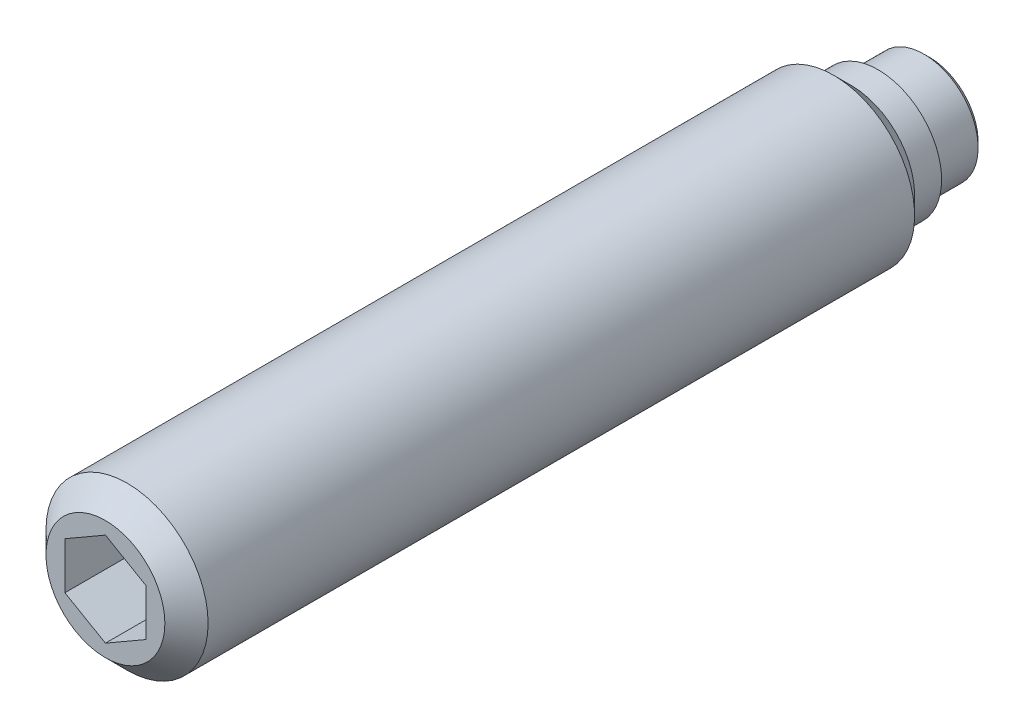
ISO-10303-21;
HEADER;
FILE_DESCRIPTION(('STEP AP214'),'2;1');
FILE_NAME('part.step','',(''),(''),'','','');
FILE_SCHEMA(('AUTOMOTIVE_DESIGN { 1 0 10303 214 1 1 1 1 }'));
ENDSEC;
DATA;
#1=APPLICATION_CONTEXT('core data for automotive mechanical design processes');
#2=APPLICATION_PROTOCOL_DEFINITION('international standard','automotive_design',2000,#1);
#3=PRODUCT_CONTEXT('',#1,'mechanical');
#4=PRODUCT('Part','Part','',(#3));
#5=PRODUCT_RELATED_PRODUCT_CATEGORY('part','',(#4));
#6=PRODUCT_DEFINITION_FORMATION('','',#4);
#7=PRODUCT_DEFINITION_CONTEXT('part definition',#1,'design');
#8=PRODUCT_DEFINITION('design','',#6,#7);
#9=PRODUCT_DEFINITION_SHAPE('','',#8);
#10=(LENGTH_UNIT() NAMED_UNIT(*) SI_UNIT(.MILLI.,.METRE.));
#11=(NAMED_UNIT(*) PLANE_ANGLE_UNIT() SI_UNIT($,.RADIAN.));
#12=(NAMED_UNIT(*) SI_UNIT($,.STERADIAN.) SOLID_ANGLE_UNIT());
#13=UNCERTAINTY_MEASURE_WITH_UNIT(LENGTH_MEASURE(1.E-05),#10,'distance_accuracy_value','');
#14=(GEOMETRIC_REPRESENTATION_CONTEXT(3) GLOBAL_UNCERTAINTY_ASSIGNED_CONTEXT((#13)) GLOBAL_UNIT_ASSIGNED_CONTEXT((#10,
#11,#12)) REPRESENTATION_CONTEXT('',''));
#15=CARTESIAN_POINT('',(0.,0.,0.));
#16=DIRECTION('',(0.,0.,1.));
#17=DIRECTION('',(1.,0.,0.));
#18=AXIS2_PLACEMENT_3D('',#15,#16,#17);
#19=CARTESIAN_POINT('',(0.,0.,1.9));
#20=DIRECTION('',(0.,0.,-1.));
#21=DIRECTION('',(-1.,0.,0.));
#22=AXIS2_PLACEMENT_3D('',#19,#20,#21);
#23=CYLINDRICAL_SURFACE('',#22,3.);
#24=CARTESIAN_POINT('',(0.,0.,29.7));
#25=DIRECTION('',(0.,0.,1.));
#26=DIRECTION('',(1.,0.,0.));
#27=AXIS2_PLACEMENT_3D('',#24,#25,#26);
#28=CIRCLE('',#27,3.);
#29=CARTESIAN_POINT('',(3.,0.,29.7));
#30=VERTEX_POINT('',#29);
#31=EDGE_CURVE('E9',#30,#30,#28,.F.);
#32=ORIENTED_EDGE('',*,*,#31,.T.);
#33=EDGE_LOOP('',(#32));
#34=FACE_BOUND('',#33,.T.);
#35=CARTESIAN_POINT('',(0.,0.,3.55));
#36=DIRECTION('',(0.,0.,-1.));
#37=DIRECTION('',(-1.,0.,0.));
#38=AXIS2_PLACEMENT_3D('',#35,#36,#37);
#39=CIRCLE('',#38,3.);
#40=CARTESIAN_POINT('',(-3.,0.,3.55));
#41=VERTEX_POINT('',#40);
#42=EDGE_CURVE('E74',#41,#41,#39,.T.);
#43=ORIENTED_EDGE('',*,*,#42,.F.);
#44=EDGE_LOOP('',(#43));
#45=FACE_BOUND('',#44,.T.);
#46=ADVANCED_FACE('F14',(#34,#45),#23,.T.);
#47=CARTESIAN_POINT('',(0.,0.,3.55));
#48=DIRECTION('',(0.,0.,1.));
#49=DIRECTION('',(1.,0.,0.));
#50=AXIS2_PLACEMENT_3D('',#47,#48,#49);
#51=CONICAL_SURFACE('',#50,3.,0.785398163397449);
#52=ORIENTED_EDGE('',*,*,#42,.T.);
#53=EDGE_LOOP('',(#52));
#54=FACE_BOUND('',#53,.T.);
#55=CARTESIAN_POINT('',(0.,0.,2.9));
#56=DIRECTION('',(0.,0.,-1.));
#57=DIRECTION('',(-1.,0.,0.));
#58=AXIS2_PLACEMENT_3D('',#55,#56,#57);
#59=CIRCLE('',#58,2.35);
#60=CARTESIAN_POINT('',(-2.35,0.,2.9));
#61=VERTEX_POINT('',#60);
#62=EDGE_CURVE('E112',#61,#61,#59,.T.);
#63=ORIENTED_EDGE('',*,*,#62,.F.);
#64=EDGE_LOOP('',(#63));
#65=FACE_BOUND('',#64,.T.);
#66=ADVANCED_FACE('F130',(#54,#65),#51,.T.);
#67=CARTESIAN_POINT('',(0.,0.,1.9));
#68=DIRECTION('',(0.,0.,-1.));
#69=DIRECTION('',(-1.,0.,0.));
#70=AXIS2_PLACEMENT_3D('',#67,#68,#69);
#71=CYLINDRICAL_SURFACE('',#70,2.35);
#72=ORIENTED_EDGE('',*,*,#62,.T.);
#73=EDGE_LOOP('',(#72));
#74=FACE_BOUND('',#73,.T.);
#75=CARTESIAN_POINT('',(0.,0.,1.9));
#76=DIRECTION('',(0.,0.,-1.));
#77=DIRECTION('',(-1.,0.,0.));
#78=AXIS2_PLACEMENT_3D('',#75,#76,#77);
#79=CIRCLE('',#78,2.35);
#80=CARTESIAN_POINT('',(-2.35,0.,1.9));
#81=VERTEX_POINT('',#80);
#82=EDGE_CURVE('E109',#81,#81,#79,.T.);
#83=ORIENTED_EDGE('',*,*,#82,.F.);
#84=EDGE_LOOP('',(#83));
#85=FACE_BOUND('',#84,.T.);
#86=ADVANCED_FACE('F135',(#74,#85),#71,.T.);
#87=CARTESIAN_POINT('',(0.,2.35,1.9));
#88=DIRECTION('',(0.,0.,1.));
#89=DIRECTION('',(1.,0.,0.));
#90=AXIS2_PLACEMENT_3D('',#87,#88,#89);
#91=PLANE('',#90);
#92=ORIENTED_EDGE('',*,*,#82,.T.);
#93=EDGE_LOOP('',(#92));
#94=FACE_BOUND('',#93,.T.);
#95=CARTESIAN_POINT('',(0.,0.,1.9));
#96=DIRECTION('',(0.,0.,-1.));
#97=DIRECTION('',(-1.,0.,0.));
#98=AXIS2_PLACEMENT_3D('',#95,#96,#97);
#99=CIRCLE('',#98,2.);
#100=CARTESIAN_POINT('',(-2.,0.,1.9));
#101=VERTEX_POINT('',#100);
#102=EDGE_CURVE('E106',#101,#101,#99,.T.);
#103=ORIENTED_EDGE('',*,*,#102,.F.);
#104=EDGE_LOOP('',(#103));
#105=FACE_BOUND('',#104,.T.);
#106=ADVANCED_FACE('F142',(#94,#105),#91,.F.);
#107=CARTESIAN_POINT('',(0.,0.,0.));
#108=DIRECTION('',(0.,0.,-1.));
#109=DIRECTION('',(-1.,0.,0.));
#110=AXIS2_PLACEMENT_3D('',#107,#108,#109);
#111=CYLINDRICAL_SURFACE('',#110,2.);
#112=CARTESIAN_POINT('',(0.,0.,0.2));
#113=DIRECTION('',(0.,0.,-1.));
#114=DIRECTION('',(-1.,0.,0.));
#115=AXIS2_PLACEMENT_3D('',#112,#113,#114);
#116=CIRCLE('',#115,2.);
#117=CARTESIAN_POINT('',(-2.,0.,0.2));
#118=VERTEX_POINT('',#117);
#119=EDGE_CURVE('E103',#118,#118,#116,.T.);
#120=ORIENTED_EDGE('',*,*,#119,.F.);
#121=EDGE_LOOP('',(#120));
#122=FACE_BOUND('',#121,.T.);
#123=ORIENTED_EDGE('',*,*,#102,.T.);
#124=EDGE_LOOP('',(#123));
#125=FACE_BOUND('',#124,.T.);
#126=ADVANCED_FACE('F146',(#122,#125),#111,.T.);
#127=CARTESIAN_POINT('',(0.,0.,0.2));
#128=DIRECTION('',(0.,0.,1.));
#129=DIRECTION('',(1.,0.,0.));
#130=AXIS2_PLACEMENT_3D('',#127,#128,#129);
#131=CONICAL_SURFACE('',#130,2.,0.785398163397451);
#132=CARTESIAN_POINT('',(0.,0.,0.));
#133=DIRECTION('',(0.,0.,-1.));
#134=DIRECTION('',(-1.,0.,0.));
#135=AXIS2_PLACEMENT_3D('',#132,#133,#134);
#136=CIRCLE('',#135,1.8);
#137=CARTESIAN_POINT('',(-1.8,0.,0.));
#138=VERTEX_POINT('',#137);
#139=EDGE_CURVE('E100',#138,#138,#136,.T.);
#140=ORIENTED_EDGE('',*,*,#139,.F.);
#141=EDGE_LOOP('',(#140));
#142=FACE_BOUND('',#141,.T.);
#143=ORIENTED_EDGE('',*,*,#119,.T.);
#144=EDGE_LOOP('',(#143));
#145=FACE_BOUND('',#144,.T.);
#146=ADVANCED_FACE('F150',(#142,#145),#131,.T.);
#147=CARTESIAN_POINT('',(0.,1.8,0.));
#148=DIRECTION('',(0.,0.,1.));
#149=DIRECTION('',(1.,0.,0.));
#150=AXIS2_PLACEMENT_3D('',#147,#148,#149);
#151=PLANE('',#150);
#152=ORIENTED_EDGE('',*,*,#139,.T.);
#153=EDGE_LOOP('',(#152));
#154=FACE_BOUND('',#153,.T.);
#155=ADVANCED_FACE('F154',(#154),#151,.F.);
#156=CARTESIAN_POINT('',(0.,0.,30.5));
#157=DIRECTION('',(0.,0.,1.));
#158=DIRECTION('',(1.,0.,0.));
#159=AXIS2_PLACEMENT_3D('',#156,#157,#158);
#160=PLANE('',#159);
#161=CARTESIAN_POINT('',(0.,0.,30.5));
#162=DIRECTION('',(0.,0.,1.));
#163=DIRECTION('',(1.,0.,0.));
#164=AXIS2_PLACEMENT_3D('',#161,#162,#163);
#165=CIRCLE('',#164,2.2);
#166=CARTESIAN_POINT('',(2.2,0.,30.5));
#167=VERTEX_POINT('',#166);
#168=EDGE_CURVE('E22',#167,#167,#165,.T.);
#169=ORIENTED_EDGE('',*,*,#168,.T.);
#170=EDGE_LOOP('',(#169));
#171=FACE_BOUND('',#170,.T.);
#172=DIRECTION('',(-0.866025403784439,0.5,0.));
#173=VECTOR('',#172,1.);
#174=CARTESIAN_POINT('',(-1.5,-0.866025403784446,30.5));
#175=LINE('',#174,#173);
#176=CARTESIAN_POINT('',(0.,-1.73205080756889,30.5));
#177=VERTEX_POINT('',#176);
#178=CARTESIAN_POINT('',(-1.5,-0.866025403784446,30.5));
#179=VERTEX_POINT('',#178);
#180=EDGE_CURVE('E69',#177,#179,#175,.T.);
#181=ORIENTED_EDGE('',*,*,#180,.T.);
#182=DIRECTION('',(0.,1.,0.));
#183=VECTOR('',#182,1.);
#184=CARTESIAN_POINT('',(-1.5,0.866025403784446,30.5));
#185=LINE('',#184,#183);
#186=CARTESIAN_POINT('',(-1.5,0.866025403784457,30.5));
#187=VERTEX_POINT('',#186);
#188=EDGE_CURVE('E84',#179,#187,#185,.T.);
#189=ORIENTED_EDGE('',*,*,#188,.T.);
#190=DIRECTION('',(0.866025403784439,0.5,0.));
#191=VECTOR('',#190,1.);
#192=CARTESIAN_POINT('',(0.,1.73205080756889,30.5));
#193=LINE('',#192,#191);
#194=CARTESIAN_POINT('',(0.,1.73205080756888,30.5));
#195=VERTEX_POINT('',#194);
#196=EDGE_CURVE('E301',#187,#195,#193,.T.);
#197=ORIENTED_EDGE('',*,*,#196,.T.);
#198=DIRECTION('',(0.866025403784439,-0.5,0.));
#199=VECTOR('',#198,1.);
#200=CARTESIAN_POINT('',(1.5,0.866025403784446,30.5));
#201=LINE('',#200,#199);
#202=CARTESIAN_POINT('',(1.5,0.866025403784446,30.5));
#203=VERTEX_POINT('',#202);
#204=EDGE_CURVE('E298',#195,#203,#201,.T.);
#205=ORIENTED_EDGE('',*,*,#204,.T.);
#206=DIRECTION('',(0.,-1.,0.));
#207=VECTOR('',#206,1.);
#208=CARTESIAN_POINT('',(1.5,-0.866025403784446,30.5));
#209=LINE('',#208,#207);
#210=CARTESIAN_POINT('',(1.5,-0.866025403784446,30.5));
#211=VERTEX_POINT('',#210);
#212=EDGE_CURVE('E29',#203,#211,#209,.T.);
#213=ORIENTED_EDGE('',*,*,#212,.T.);
#214=DIRECTION('',(-0.866025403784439,-0.5,0.));
#215=VECTOR('',#214,1.);
#216=CARTESIAN_POINT('',(0.,-1.73205080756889,30.5));
#217=LINE('',#216,#215);
#218=EDGE_CURVE('E66',#211,#177,#217,.T.);
#219=ORIENTED_EDGE('',*,*,#218,.T.);
#220=EDGE_LOOP('',(#181,#189,#197,#205,#213,#219));
#221=FACE_BOUND('',#220,.T.);
#222=ADVANCED_FACE('F68',(#171,#221),#160,.T.);
#223=CARTESIAN_POINT('',(0.,0.,27.));
#224=DIRECTION('',(0.,0.,1.));
#225=DIRECTION('',(1.,0.,0.));
#226=AXIS2_PLACEMENT_3D('',#223,#224,#225);
#227=PLANE('',#226);
#228=DIRECTION('',(0.,-1.,0.));
#229=VECTOR('',#228,1.);
#230=CARTESIAN_POINT('',(-1.5,0.866025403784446,27.));
#231=LINE('',#230,#229);
#232=CARTESIAN_POINT('',(-1.5,0.866025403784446,27.));
#233=VERTEX_POINT('',#232);
#234=CARTESIAN_POINT('',(-1.5,-0.866025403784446,27.));
#235=VERTEX_POINT('',#234);
#236=EDGE_CURVE('E83',#233,#235,#231,.T.);
#237=ORIENTED_EDGE('',*,*,#236,.T.);
#238=DIRECTION('',(0.866025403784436,-0.5,0.));
#239=VECTOR('',#238,1.);
#240=CARTESIAN_POINT('',(-1.5,-0.866025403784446,27.));
#241=LINE('',#240,#239);
#242=CARTESIAN_POINT('',(0.,-1.73205080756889,27.));
#243=VERTEX_POINT('',#242);
#244=EDGE_CURVE('E280',#235,#243,#241,.T.);
#245=ORIENTED_EDGE('',*,*,#244,.T.);
#246=DIRECTION('',(0.866025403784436,0.5,0.));
#247=VECTOR('',#246,1.);
#248=CARTESIAN_POINT('',(0.,-1.73205080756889,27.));
#249=LINE('',#248,#247);
#250=CARTESIAN_POINT('',(1.5,-0.866025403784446,27.));
#251=VERTEX_POINT('',#250);
#252=EDGE_CURVE('E88',#243,#251,#249,.T.);
#253=ORIENTED_EDGE('',*,*,#252,.T.);
#254=DIRECTION('',(0.,1.,0.));
#255=VECTOR('',#254,1.);
#256=CARTESIAN_POINT('',(1.5,-0.866025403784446,27.));
#257=LINE('',#256,#255);
#258=CARTESIAN_POINT('',(1.5,0.866025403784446,27.));
#259=VERTEX_POINT('',#258);
#260=EDGE_CURVE('E287',#251,#259,#257,.T.);
#261=ORIENTED_EDGE('',*,*,#260,.T.);
#262=DIRECTION('',(-0.866025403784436,0.5,0.));
#263=VECTOR('',#262,1.);
#264=CARTESIAN_POINT('',(1.5,0.866025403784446,27.));
#265=LINE('',#264,#263);
#266=CARTESIAN_POINT('',(0.,1.73205080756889,27.));
#267=VERTEX_POINT('',#266);
#268=EDGE_CURVE('E96',#259,#267,#265,.T.);
#269=ORIENTED_EDGE('',*,*,#268,.T.);
#270=DIRECTION('',(-0.866025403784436,-0.5,0.));
#271=VECTOR('',#270,1.);
#272=CARTESIAN_POINT('',(0.,1.73205080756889,27.));
#273=LINE('',#272,#271);
#274=EDGE_CURVE('E91',#267,#233,#273,.T.);
#275=ORIENTED_EDGE('',*,*,#274,.T.);
#276=EDGE_LOOP('',(#237,#245,#253,#261,#269,#275));
#277=FACE_BOUND('',#276,.T.);
#278=ADVANCED_FACE('F162',(#277),#227,.T.);
#279=CARTESIAN_POINT('',(0.,-1.73205080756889,38.));
#280=DIRECTION('',(0.5,-0.866025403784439,0.));
#281=DIRECTION('',(0.866025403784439,0.5,0.));
#282=AXIS2_PLACEMENT_3D('',#279,#280,#281);
#283=PLANE('',#282);
#284=ORIENTED_EDGE('',*,*,#218,.F.);
#285=DIRECTION('',(0.,0.,1.));
#286=VECTOR('',#285,1.);
#287=CARTESIAN_POINT('',(1.5,-0.866025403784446,38.));
#288=LINE('',#287,#286);
#289=EDGE_CURVE('E90',#251,#211,#288,.T.);
#290=ORIENTED_EDGE('',*,*,#289,.F.);
#291=ORIENTED_EDGE('',*,*,#252,.F.);
#292=DIRECTION('',(0.,0.,1.));
#293=VECTOR('',#292,1.);
#294=CARTESIAN_POINT('',(0.,-1.73205080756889,38.));
#295=LINE('',#294,#293);
#296=EDGE_CURVE('E80',#243,#177,#295,.T.);
#297=ORIENTED_EDGE('',*,*,#296,.T.);
#298=EDGE_LOOP('',(#284,#290,#291,#297));
#299=FACE_BOUND('',#298,.T.);
#300=ADVANCED_FACE('F86',(#299),#283,.F.);
#301=CARTESIAN_POINT('',(1.5,-0.866025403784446,38.));
#302=DIRECTION('',(1.,0.,0.));
#303=DIRECTION('',(0.,0.,-1.));
#304=AXIS2_PLACEMENT_3D('',#301,#302,#303);
#305=PLANE('',#304);
#306=ORIENTED_EDGE('',*,*,#212,.F.);
#307=DIRECTION('',(0.,0.,1.));
#308=VECTOR('',#307,1.);
#309=CARTESIAN_POINT('',(1.5,0.866025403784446,38.));
#310=LINE('',#309,#308);
#311=EDGE_CURVE('E93',#259,#203,#310,.T.);
#312=ORIENTED_EDGE('',*,*,#311,.F.);
#313=ORIENTED_EDGE('',*,*,#260,.F.);
#314=ORIENTED_EDGE('',*,*,#289,.T.);
#315=EDGE_LOOP('',(#306,#312,#313,#314));
#316=FACE_BOUND('',#315,.T.);
#317=ADVANCED_FACE('F161',(#316),#305,.F.);
#318=CARTESIAN_POINT('',(1.5,0.866025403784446,38.));
#319=DIRECTION('',(0.5,0.866025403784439,0.));
#320=DIRECTION('',(-0.866025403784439,0.5,0.));
#321=AXIS2_PLACEMENT_3D('',#318,#319,#320);
#322=PLANE('',#321);
#323=ORIENTED_EDGE('',*,*,#204,.F.);
#324=DIRECTION('',(0.,0.,1.));
#325=VECTOR('',#324,1.);
#326=CARTESIAN_POINT('',(0.,1.73205080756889,38.));
#327=LINE('',#326,#325);
#328=EDGE_CURVE('E293',#267,#195,#327,.T.);
#329=ORIENTED_EDGE('',*,*,#328,.F.);
#330=ORIENTED_EDGE('',*,*,#268,.F.);
#331=ORIENTED_EDGE('',*,*,#311,.T.);
#332=EDGE_LOOP('',(#323,#329,#330,#331));
#333=FACE_BOUND('',#332,.T.);
#334=ADVANCED_FACE('F165',(#333),#322,.F.);
#335=CARTESIAN_POINT('',(0.,1.73205080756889,38.));
#336=DIRECTION('',(-0.5,0.866025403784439,0.));
#337=DIRECTION('',(-0.866025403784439,-0.5,0.));
#338=AXIS2_PLACEMENT_3D('',#335,#336,#337);
#339=PLANE('',#338);
#340=ORIENTED_EDGE('',*,*,#196,.F.);
#341=DIRECTION('',(0.,0.,1.));
#342=VECTOR('',#341,1.);
#343=CARTESIAN_POINT('',(-1.5,0.866025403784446,38.));
#344=LINE('',#343,#342);
#345=EDGE_CURVE('E37',#233,#187,#344,.T.);
#346=ORIENTED_EDGE('',*,*,#345,.F.);
#347=ORIENTED_EDGE('',*,*,#274,.F.);
#348=ORIENTED_EDGE('',*,*,#328,.T.);
#349=EDGE_LOOP('',(#340,#346,#347,#348));
#350=FACE_BOUND('',#349,.T.);
#351=ADVANCED_FACE('F169',(#350),#339,.F.);
#352=CARTESIAN_POINT('',(-1.5,0.866025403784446,38.));
#353=DIRECTION('',(-1.,0.,0.));
#354=DIRECTION('',(0.,0.,1.));
#355=AXIS2_PLACEMENT_3D('',#352,#353,#354);
#356=PLANE('',#355);
#357=ORIENTED_EDGE('',*,*,#188,.F.);
#358=DIRECTION('',(0.,0.,1.));
#359=VECTOR('',#358,1.);
#360=CARTESIAN_POINT('',(-1.5,-0.866025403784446,38.));
#361=LINE('',#360,#359);
#362=EDGE_CURVE('E82',#235,#179,#361,.T.);
#363=ORIENTED_EDGE('',*,*,#362,.F.);
#364=ORIENTED_EDGE('',*,*,#236,.F.);
#365=ORIENTED_EDGE('',*,*,#345,.T.);
#366=EDGE_LOOP('',(#357,#363,#364,#365));
#367=FACE_BOUND('',#366,.T.);
#368=ADVANCED_FACE('F126',(#367),#356,.F.);
#369=CARTESIAN_POINT('',(-1.5,-0.866025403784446,38.));
#370=DIRECTION('',(-0.5,-0.866025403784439,0.));
#371=DIRECTION('',(0.866025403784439,-0.5,0.));
#372=AXIS2_PLACEMENT_3D('',#369,#370,#371);
#373=PLANE('',#372);
#374=ORIENTED_EDGE('',*,*,#180,.F.);
#375=ORIENTED_EDGE('',*,*,#296,.F.);
#376=ORIENTED_EDGE('',*,*,#244,.F.);
#377=ORIENTED_EDGE('',*,*,#362,.T.);
#378=EDGE_LOOP('',(#374,#375,#376,#377));
#379=FACE_BOUND('',#378,.T.);
#380=ADVANCED_FACE('F78',(#379),#373,.F.);
#381=CARTESIAN_POINT('',(0.,0.,30.5));
#382=DIRECTION('',(0.,0.,-1.));
#383=DIRECTION('',(-1.,0.,0.));
#384=AXIS2_PLACEMENT_3D('',#381,#382,#383);
#385=CONICAL_SURFACE('',#384,2.2,0.785398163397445);
#386=ORIENTED_EDGE('',*,*,#31,.F.);
#387=EDGE_LOOP('',(#386));
#388=FACE_BOUND('',#387,.T.);
#389=ORIENTED_EDGE('',*,*,#168,.F.);
#390=EDGE_LOOP('',(#389));
#391=FACE_BOUND('',#390,.T.);
#392=ADVANCED_FACE('F16',(#388,#391),#385,.T.);
#393=CLOSED_SHELL('',(#46,#66,#86,#106,#126,#146,#155,#222,#278,#300,#317,#334,#351,#368,#380,#392));
#394=MANIFOLD_SOLID_BREP('B1',#393);
#395=ADVANCED_BREP_SHAPE_REPRESENTATION('',(#18,#394),#14);
#396=SHAPE_DEFINITION_REPRESENTATION(#9,#395);
ENDSEC;
END-ISO-10303-21;
